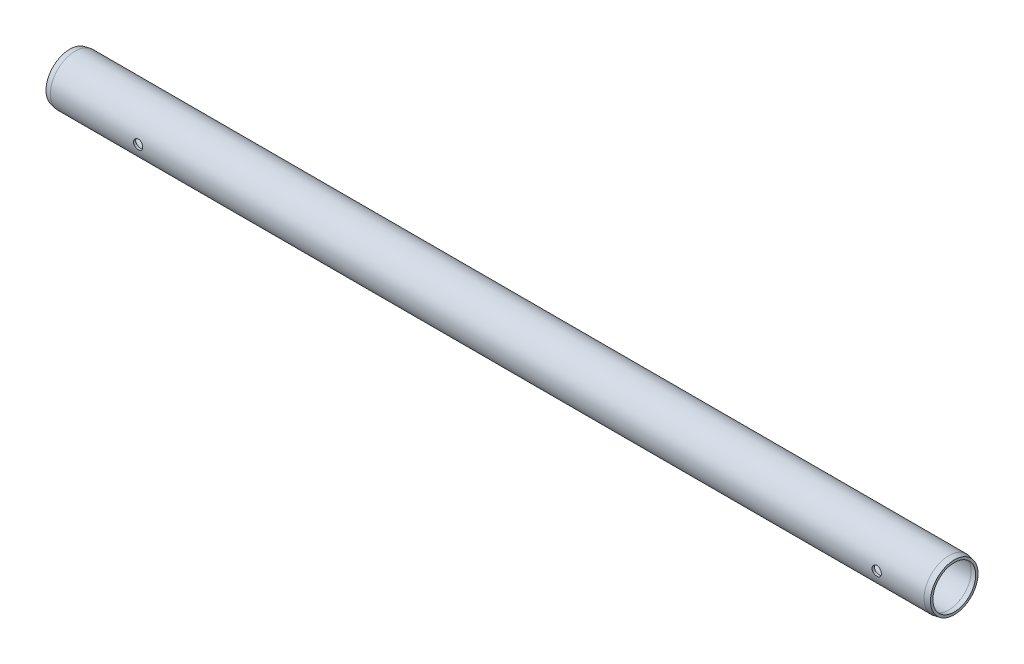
ISO-10303-21;
HEADER;
FILE_DESCRIPTION(('STEP AP214'),'2;1');
FILE_NAME('part.step','',(''),(''),'','','');
FILE_SCHEMA(('AUTOMOTIVE_DESIGN { 1 0 10303 214 1 1 1 1 }'));
ENDSEC;
DATA;
#1=APPLICATION_CONTEXT('core data for automotive mechanical design processes');
#2=APPLICATION_PROTOCOL_DEFINITION('international standard','automotive_design',2000,#1);
#3=PRODUCT_CONTEXT('',#1,'mechanical');
#4=PRODUCT('Part','Part','',(#3));
#5=PRODUCT_RELATED_PRODUCT_CATEGORY('part','',(#4));
#6=PRODUCT_DEFINITION_FORMATION('','',#4);
#7=PRODUCT_DEFINITION_CONTEXT('part definition',#1,'design');
#8=PRODUCT_DEFINITION('design','',#6,#7);
#9=PRODUCT_DEFINITION_SHAPE('','',#8);
#10=(LENGTH_UNIT() NAMED_UNIT(*) SI_UNIT(.MILLI.,.METRE.));
#11=(NAMED_UNIT(*) PLANE_ANGLE_UNIT() SI_UNIT($,.RADIAN.));
#12=(NAMED_UNIT(*) SI_UNIT($,.STERADIAN.) SOLID_ANGLE_UNIT());
#13=UNCERTAINTY_MEASURE_WITH_UNIT(LENGTH_MEASURE(1.E-05),#10,'distance_accuracy_value','');
#14=(GEOMETRIC_REPRESENTATION_CONTEXT(3) GLOBAL_UNCERTAINTY_ASSIGNED_CONTEXT((#13)) GLOBAL_UNIT_ASSIGNED_CONTEXT((#10,
#11,#12)) REPRESENTATION_CONTEXT('',''));
#15=CARTESIAN_POINT('',(0.,0.,0.));
#16=DIRECTION('',(0.,0.,1.));
#17=DIRECTION('',(1.,0.,0.));
#18=AXIS2_PLACEMENT_3D('',#15,#16,#17);
#19=CARTESIAN_POINT('',(0.,0.,0.));
#20=DIRECTION('',(-1.,0.,0.));
#21=DIRECTION('',(0.,0.,1.));
#22=AXIS2_PLACEMENT_3D('',#19,#20,#21);
#23=CYLINDRICAL_SURFACE('',#22,7.25);
#24=CARTESIAN_POINT('',(269.5,0.,7.25));
#25=CARTESIAN_POINT('',(269.499997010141,0.0833039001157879,7.24999845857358));
#26=CARTESIAN_POINT('',(269.49303701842,0.166644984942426,7.248549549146));
#27=CARTESIAN_POINT('',(269.465405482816,0.330967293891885,7.2429093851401));
#28=CARTESIAN_POINT('',(269.444723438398,0.411946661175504,7.23871603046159));
#29=CARTESIAN_POINT('',(269.390317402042,0.569146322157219,7.22805474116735));
#30=CARTESIAN_POINT('',(269.356606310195,0.645371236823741,7.2215890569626));
#31=CARTESIAN_POINT('',(269.277138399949,0.791078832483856,7.20708417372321));
#32=CARTESIAN_POINT('',(269.231382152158,0.860561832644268,7.19904504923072));
#33=CARTESIAN_POINT('',(269.128422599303,0.99182113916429,7.18214677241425));
#34=CARTESIAN_POINT('',(269.07107881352,1.05348607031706,7.17327835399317));
#35=CARTESIAN_POINT('',(268.94687381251,1.16639392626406,7.15578765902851));
#36=CARTESIAN_POINT('',(268.880011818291,1.21763599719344,7.1471654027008));
#37=CARTESIAN_POINT('',(268.737859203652,1.30872383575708,7.13105249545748));
#38=CARTESIAN_POINT('',(268.662492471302,1.34845311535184,7.12357375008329));
#39=CARTESIAN_POINT('',(268.505972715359,1.41464100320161,7.11072675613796));
#40=CARTESIAN_POINT('',(268.42482030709,1.44110102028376,7.10535828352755));
#41=CARTESIAN_POINT('',(268.260234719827,1.47963536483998,7.0974336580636));
#42=CARTESIAN_POINT('',(268.176849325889,1.49190575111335,7.09483921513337));
#43=CARTESIAN_POINT('',(268.009166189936,1.50232173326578,7.0926412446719));
#44=CARTESIAN_POINT('',(267.924868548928,1.5004688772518,7.09303738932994));
#45=CARTESIAN_POINT('',(267.759196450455,1.48284922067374,7.09674108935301));
#46=CARTESIAN_POINT('',(267.677796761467,1.46730824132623,7.10000139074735));
#47=CARTESIAN_POINT('',(267.51878553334,1.42311041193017,7.10899153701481));
#48=CARTESIAN_POINT('',(267.441174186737,1.39445289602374,7.11472150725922));
#49=CARTESIAN_POINT('',(267.291297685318,1.32462283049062,7.12805305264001));
#50=CARTESIAN_POINT('',(267.219075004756,1.28336173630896,7.135667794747));
#51=CARTESIAN_POINT('',(267.082494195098,1.18955816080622,7.15190257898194));
#52=CARTESIAN_POINT('',(267.018137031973,1.13701429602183,7.16052274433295));
#53=CARTESIAN_POINT('',(266.897812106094,1.02093253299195,7.17800111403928));
#54=CARTESIAN_POINT('',(266.842030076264,0.957202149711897,7.18686070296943));
#55=CARTESIAN_POINT('',(266.741917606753,0.82119353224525,7.20366773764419));
#56=CARTESIAN_POINT('',(266.697587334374,0.748915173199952,7.21161517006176));
#57=CARTESIAN_POINT('',(266.621598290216,0.597648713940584,7.22572411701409));
#58=CARTESIAN_POINT('',(266.589961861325,0.518649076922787,7.23188247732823));
#59=CARTESIAN_POINT('',(266.540462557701,0.356300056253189,7.24169565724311));
#60=CARTESIAN_POINT('',(266.522597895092,0.272951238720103,7.2453508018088));
#61=CARTESIAN_POINT('',(266.501414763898,0.105864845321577,7.24970009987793));
#62=CARTESIAN_POINT('',(266.497842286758,0.0221607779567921,7.25044595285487));
#63=CARTESIAN_POINT('',(266.504659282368,-0.144648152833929,7.24903668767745));
#64=CARTESIAN_POINT('',(266.515047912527,-0.227753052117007,7.2468817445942));
#65=CARTESIAN_POINT('',(266.549281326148,-0.390177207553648,7.23994546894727));
#66=CARTESIAN_POINT('',(266.572994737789,-0.469525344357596,7.23518978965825));
#67=CARTESIAN_POINT('',(266.633060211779,-0.623118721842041,7.22358363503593));
#68=CARTESIAN_POINT('',(266.669413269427,-0.697363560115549,7.21673299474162));
#69=CARTESIAN_POINT('',(266.754268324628,-0.839706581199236,7.20156844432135));
#70=CARTESIAN_POINT('',(266.802921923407,-0.907712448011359,7.19323669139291));
#71=CARTESIAN_POINT('',(266.910795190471,-1.03468569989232,7.17607398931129));
#72=CARTESIAN_POINT('',(266.97001607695,-1.09365204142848,7.16724298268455));
#73=CARTESIAN_POINT('',(267.09850263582,-1.20186137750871,7.14990125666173));
#74=CARTESIAN_POINT('',(267.167916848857,-1.25092943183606,7.14139814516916));
#75=CARTESIAN_POINT('',(267.31415094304,-1.33671076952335,7.1258411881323));
#76=CARTESIAN_POINT('',(267.390970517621,-1.37342456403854,7.11878728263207));
#77=CARTESIAN_POINT('',(267.549436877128,-1.43322178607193,7.10698989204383));
#78=CARTESIAN_POINT('',(267.63105511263,-1.4563783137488,7.10223404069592));
#79=CARTESIAN_POINT('',(267.797133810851,-1.48862289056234,7.09554634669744));
#80=CARTESIAN_POINT('',(267.881593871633,-1.49771292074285,7.09361410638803));
#81=CARTESIAN_POINT('',(268.049199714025,-1.50148916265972,7.09281556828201));
#82=CARTESIAN_POINT('',(268.132339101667,-1.49645212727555,7.09389036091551));
#83=CARTESIAN_POINT('',(268.296557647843,-1.47273085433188,7.09885258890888));
#84=CARTESIAN_POINT('',(268.377636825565,-1.45404674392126,7.10273999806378));
#85=CARTESIAN_POINT('',(268.535241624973,-1.40368889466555,7.11286224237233));
#86=CARTESIAN_POINT('',(268.611779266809,-1.37205137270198,7.11909052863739));
#87=CARTESIAN_POINT('',(268.758502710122,-1.29671750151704,7.13319604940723));
#88=CARTESIAN_POINT('',(268.828687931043,-1.25302005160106,7.14107343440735));
#89=CARTESIAN_POINT('',(268.962087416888,-1.15387128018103,7.15776829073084));
#90=CARTESIAN_POINT('',(269.025152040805,-1.09822102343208,7.16660022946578));
#91=CARTESIAN_POINT('',(269.141138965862,-0.977154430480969,7.18410765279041));
#92=CARTESIAN_POINT('',(269.194058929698,-0.911735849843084,7.19278310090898));
#93=CARTESIAN_POINT('',(269.28882416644,-0.772096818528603,7.20911635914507));
#94=CARTESIAN_POINT('',(269.330537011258,-0.697784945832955,7.21676151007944));
#95=CARTESIAN_POINT('',(269.400815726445,-0.543066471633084,7.23004740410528));
#96=CARTESIAN_POINT('',(269.429393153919,-0.462665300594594,7.23568990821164));
#97=CARTESIAN_POINT('',(269.467212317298,-0.318431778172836,7.24327038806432));
#98=CARTESIAN_POINT('',(269.479485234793,-0.25540657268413,7.24577891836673));
#99=CARTESIAN_POINT('',(269.495880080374,-0.128261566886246,7.24914428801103));
#100=CARTESIAN_POINT('',(269.500002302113,-0.0641418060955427,7.25000118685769));
#101=CARTESIAN_POINT('',(269.5,0.,7.25));
#102=B_SPLINE_CURVE_WITH_KNOTS('',3,(#24,#25,#26,#27,#28,#29,#30,#31,#32,#33,#34,#35,#36,#37,
#38,#39,#40,#41,#42,#43,#44,#45,#46,#47,#48,#49,#50,#51,#52,#53,#54,#55,#56,#57,#58,#59,#60,#61,
#62,#63,#64,#65,#66,#67,#68,#69,#70,#71,#72,#73,#74,#75,#76,#77,#78,#79,#80,#81,#82,#83,#84,#85,
#86,#87,#88,#89,#90,#91,#92,#93,#94,#95,#96,#97,#98,#99,#100,#101),.UNSPECIFIED.,.T.,.F.,(4,2,2,
2,2,2,2,2,2,2,2,2,2,2,2,2,2,2,2,2,2,2,2,2,2,2,2,2,2,2,2,2,2,2,2,2,2,2,4),(0.,0.249677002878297,
0.499545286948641,0.749166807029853,0.998776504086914,1.25161657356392,1.50447734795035,
1.75981377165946,2.01512307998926,2.26686095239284,2.5185712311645,2.76620508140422,
3.01385150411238,3.26327938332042,3.51273786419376,3.7670073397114,4.02128052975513,
4.27599933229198,4.53068506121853,4.78082371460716,5.03094727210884,5.27864701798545,
5.52636627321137,5.7773016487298,6.02826597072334,6.28333787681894,6.53839922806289,
6.7920723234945,7.04570968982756,7.2944131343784,7.54311426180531,7.79112473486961,
8.03915785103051,8.29169270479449,8.5442856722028,8.79974378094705,9.05497669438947,
9.24722832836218,9.43947303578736),.UNSPECIFIED.);
#103=CARTESIAN_POINT('',(269.5,0.,7.25));
#104=VERTEX_POINT('',#103);
#105=EDGE_CURVE('E61',#104,#104,#102,.T.);
#106=ORIENTED_EDGE('',*,*,#105,.T.);
#107=EDGE_LOOP('',(#106));
#108=FACE_BOUND('',#107,.T.);
#109=CARTESIAN_POINT('',(269.5,0.,-7.25));
#110=CARTESIAN_POINT('',(269.499997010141,-0.0833039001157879,-7.24999845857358));
#111=CARTESIAN_POINT('',(269.49303701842,-0.166644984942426,-7.248549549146));
#112=CARTESIAN_POINT('',(269.465405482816,-0.330967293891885,-7.2429093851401));
#113=CARTESIAN_POINT('',(269.444723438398,-0.411946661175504,-7.23871603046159));
#114=CARTESIAN_POINT('',(269.390317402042,-0.569146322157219,-7.22805474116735));
#115=CARTESIAN_POINT('',(269.356606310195,-0.645371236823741,-7.2215890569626));
#116=CARTESIAN_POINT('',(269.277138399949,-0.791078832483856,-7.20708417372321));
#117=CARTESIAN_POINT('',(269.231382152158,-0.860561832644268,-7.19904504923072));
#118=CARTESIAN_POINT('',(269.128422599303,-0.99182113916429,-7.18214677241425));
#119=CARTESIAN_POINT('',(269.07107881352,-1.05348607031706,-7.17327835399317));
#120=CARTESIAN_POINT('',(268.94687381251,-1.16639392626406,-7.15578765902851));
#121=CARTESIAN_POINT('',(268.880011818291,-1.21763599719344,-7.1471654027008));
#122=CARTESIAN_POINT('',(268.737859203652,-1.30872383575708,-7.13105249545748));
#123=CARTESIAN_POINT('',(268.662492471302,-1.34845311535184,-7.12357375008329));
#124=CARTESIAN_POINT('',(268.505972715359,-1.41464100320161,-7.11072675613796));
#125=CARTESIAN_POINT('',(268.42482030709,-1.44110102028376,-7.10535828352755));
#126=CARTESIAN_POINT('',(268.260234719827,-1.47963536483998,-7.0974336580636));
#127=CARTESIAN_POINT('',(268.176849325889,-1.49190575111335,-7.09483921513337));
#128=CARTESIAN_POINT('',(268.009166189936,-1.50232173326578,-7.0926412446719));
#129=CARTESIAN_POINT('',(267.924868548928,-1.5004688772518,-7.09303738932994));
#130=CARTESIAN_POINT('',(267.759196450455,-1.48284922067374,-7.09674108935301));
#131=CARTESIAN_POINT('',(267.677796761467,-1.46730824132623,-7.10000139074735));
#132=CARTESIAN_POINT('',(267.51878553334,-1.42311041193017,-7.10899153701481));
#133=CARTESIAN_POINT('',(267.441174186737,-1.39445289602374,-7.11472150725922));
#134=CARTESIAN_POINT('',(267.291297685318,-1.32462283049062,-7.12805305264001));
#135=CARTESIAN_POINT('',(267.219075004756,-1.28336173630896,-7.135667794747));
#136=CARTESIAN_POINT('',(267.082494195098,-1.18955816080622,-7.15190257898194));
#137=CARTESIAN_POINT('',(267.018137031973,-1.13701429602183,-7.16052274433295));
#138=CARTESIAN_POINT('',(266.897812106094,-1.02093253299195,-7.17800111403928));
#139=CARTESIAN_POINT('',(266.842030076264,-0.957202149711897,-7.18686070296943));
#140=CARTESIAN_POINT('',(266.741917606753,-0.82119353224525,-7.20366773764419));
#141=CARTESIAN_POINT('',(266.697587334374,-0.748915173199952,-7.21161517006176));
#142=CARTESIAN_POINT('',(266.621598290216,-0.597648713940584,-7.22572411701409));
#143=CARTESIAN_POINT('',(266.589961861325,-0.518649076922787,-7.23188247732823));
#144=CARTESIAN_POINT('',(266.540462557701,-0.356300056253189,-7.24169565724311));
#145=CARTESIAN_POINT('',(266.522597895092,-0.272951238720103,-7.2453508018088));
#146=CARTESIAN_POINT('',(266.501414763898,-0.105864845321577,-7.24970009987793));
#147=CARTESIAN_POINT('',(266.497842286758,-0.0221607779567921,-7.25044595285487));
#148=CARTESIAN_POINT('',(266.504659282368,0.144648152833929,-7.24903668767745));
#149=CARTESIAN_POINT('',(266.515047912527,0.227753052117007,-7.2468817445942));
#150=CARTESIAN_POINT('',(266.549281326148,0.390177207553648,-7.23994546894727));
#151=CARTESIAN_POINT('',(266.572994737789,0.469525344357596,-7.23518978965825));
#152=CARTESIAN_POINT('',(266.633060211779,0.623118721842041,-7.22358363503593));
#153=CARTESIAN_POINT('',(266.669413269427,0.697363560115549,-7.21673299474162));
#154=CARTESIAN_POINT('',(266.754268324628,0.839706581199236,-7.20156844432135));
#155=CARTESIAN_POINT('',(266.802921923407,0.907712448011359,-7.19323669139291));
#156=CARTESIAN_POINT('',(266.910795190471,1.03468569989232,-7.17607398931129));
#157=CARTESIAN_POINT('',(266.97001607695,1.09365204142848,-7.16724298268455));
#158=CARTESIAN_POINT('',(267.09850263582,1.20186137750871,-7.14990125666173));
#159=CARTESIAN_POINT('',(267.167916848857,1.25092943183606,-7.14139814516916));
#160=CARTESIAN_POINT('',(267.31415094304,1.33671076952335,-7.1258411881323));
#161=CARTESIAN_POINT('',(267.390970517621,1.37342456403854,-7.11878728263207));
#162=CARTESIAN_POINT('',(267.549436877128,1.43322178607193,-7.10698989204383));
#163=CARTESIAN_POINT('',(267.63105511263,1.4563783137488,-7.10223404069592));
#164=CARTESIAN_POINT('',(267.797133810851,1.48862289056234,-7.09554634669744));
#165=CARTESIAN_POINT('',(267.881593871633,1.49771292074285,-7.09361410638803));
#166=CARTESIAN_POINT('',(268.049199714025,1.50148916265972,-7.09281556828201));
#167=CARTESIAN_POINT('',(268.132339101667,1.49645212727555,-7.09389036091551));
#168=CARTESIAN_POINT('',(268.296557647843,1.47273085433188,-7.09885258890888));
#169=CARTESIAN_POINT('',(268.377636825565,1.45404674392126,-7.10273999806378));
#170=CARTESIAN_POINT('',(268.535241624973,1.40368889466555,-7.11286224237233));
#171=CARTESIAN_POINT('',(268.611779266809,1.37205137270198,-7.11909052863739));
#172=CARTESIAN_POINT('',(268.758502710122,1.29671750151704,-7.13319604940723));
#173=CARTESIAN_POINT('',(268.828687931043,1.25302005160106,-7.14107343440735));
#174=CARTESIAN_POINT('',(268.962087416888,1.15387128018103,-7.15776829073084));
#175=CARTESIAN_POINT('',(269.025152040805,1.09822102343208,-7.16660022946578));
#176=CARTESIAN_POINT('',(269.141138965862,0.977154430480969,-7.18410765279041));
#177=CARTESIAN_POINT('',(269.194058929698,0.911735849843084,-7.19278310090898));
#178=CARTESIAN_POINT('',(269.28882416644,0.772096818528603,-7.20911635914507));
#179=CARTESIAN_POINT('',(269.330537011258,0.697784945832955,-7.21676151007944));
#180=CARTESIAN_POINT('',(269.400815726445,0.543066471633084,-7.23004740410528));
#181=CARTESIAN_POINT('',(269.429393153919,0.462665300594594,-7.23568990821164));
#182=CARTESIAN_POINT('',(269.467212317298,0.318431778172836,-7.24327038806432));
#183=CARTESIAN_POINT('',(269.479485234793,0.25540657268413,-7.24577891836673));
#184=CARTESIAN_POINT('',(269.495880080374,0.128261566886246,-7.24914428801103));
#185=CARTESIAN_POINT('',(269.500002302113,0.0641418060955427,-7.25000118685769));
#186=CARTESIAN_POINT('',(269.5,0.,-7.25));
#187=B_SPLINE_CURVE_WITH_KNOTS('',3,(#109,#110,#111,#112,#113,#114,#115,#116,#117,#118,#119,
#120,#121,#122,#123,#124,#125,#126,#127,#128,#129,#130,#131,#132,#133,#134,#135,#136,#137,#138,
#139,#140,#141,#142,#143,#144,#145,#146,#147,#148,#149,#150,#151,#152,#153,#154,#155,#156,#157,
#158,#159,#160,#161,#162,#163,#164,#165,#166,#167,#168,#169,#170,#171,#172,#173,#174,#175,#176,
#177,#178,#179,#180,#181,#182,#183,#184,#185,#186),.UNSPECIFIED.,.T.,.F.,(4,2,2,2,2,2,2,2,2,2,2,
2,2,2,2,2,2,2,2,2,2,2,2,2,2,2,2,2,2,2,2,2,2,2,2,2,2,2,4),(0.,0.249677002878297,
0.499545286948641,0.749166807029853,0.998776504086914,1.25161657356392,1.50447734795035,
1.75981377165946,2.01512307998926,2.26686095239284,2.5185712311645,2.76620508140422,
3.01385150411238,3.26327938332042,3.51273786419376,3.7670073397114,4.02128052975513,
4.27599933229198,4.53068506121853,4.78082371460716,5.03094727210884,5.27864701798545,
5.52636627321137,5.7773016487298,6.02826597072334,6.28333787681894,6.53839922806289,
6.7920723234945,7.04570968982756,7.2944131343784,7.54311426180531,7.79112473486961,
8.03915785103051,8.29169270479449,8.5442856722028,8.79974378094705,9.05497669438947,
9.24722832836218,9.43947303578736),.UNSPECIFIED.);
#188=CARTESIAN_POINT('',(269.5,0.,-7.25));
#189=VERTEX_POINT('',#188);
#190=EDGE_CURVE('E149',#189,#189,#187,.T.);
#191=ORIENTED_EDGE('',*,*,#190,.T.);
#192=EDGE_LOOP('',(#191));
#193=FACE_BOUND('',#192,.T.);
#194=CARTESIAN_POINT('',(31.5,0.,7.25));
#195=CARTESIAN_POINT('',(31.4999970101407,0.0833039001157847,7.24999845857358));
#196=CARTESIAN_POINT('',(31.4930370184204,0.166644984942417,7.248549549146));
#197=CARTESIAN_POINT('',(31.4654054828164,0.330967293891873,7.2429093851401));
#198=CARTESIAN_POINT('',(31.4447234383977,0.411946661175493,7.23871603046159));
#199=CARTESIAN_POINT('',(31.3903174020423,0.5691463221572,7.22805474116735));
#200=CARTESIAN_POINT('',(31.3566063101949,0.645371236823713,7.2215890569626));
#201=CARTESIAN_POINT('',(31.2771383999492,0.791078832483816,7.20708417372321));
#202=CARTESIAN_POINT('',(31.2313821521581,0.860561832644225,7.19904504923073));
#203=CARTESIAN_POINT('',(31.1284225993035,0.991821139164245,7.18214677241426));
#204=CARTESIAN_POINT('',(31.0710788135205,1.05348607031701,7.17327835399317));
#205=CARTESIAN_POINT('',(30.9468738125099,1.16639392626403,7.15578765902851));
#206=CARTESIAN_POINT('',(30.8800118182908,1.21763599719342,7.14716540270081));
#207=CARTESIAN_POINT('',(30.7378592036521,1.30872383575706,7.13105249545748));
#208=CARTESIAN_POINT('',(30.6624924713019,1.34845311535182,7.12357375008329));
#209=CARTESIAN_POINT('',(30.5059727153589,1.41464100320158,7.11072675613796));
#210=CARTESIAN_POINT('',(30.4248203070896,1.44110102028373,7.10535828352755));
#211=CARTESIAN_POINT('',(30.2602347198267,1.47963536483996,7.0974336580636));
#212=CARTESIAN_POINT('',(30.1768493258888,1.49190575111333,7.09483921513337));
#213=CARTESIAN_POINT('',(30.0091661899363,1.50232173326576,7.0926412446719));
#214=CARTESIAN_POINT('',(29.9248685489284,1.50046887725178,7.09303738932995));
#215=CARTESIAN_POINT('',(29.7591964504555,1.48284922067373,7.09674108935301));
#216=CARTESIAN_POINT('',(29.6777967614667,1.46730824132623,7.10000139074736));
#217=CARTESIAN_POINT('',(29.5187855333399,1.42311041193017,7.10899153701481));
#218=CARTESIAN_POINT('',(29.4411741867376,1.39445289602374,7.11472150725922));
#219=CARTESIAN_POINT('',(29.2912976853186,1.32462283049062,7.12805305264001));
#220=CARTESIAN_POINT('',(29.2190750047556,1.28336173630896,7.13566779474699));
#221=CARTESIAN_POINT('',(29.0824941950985,1.18955816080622,7.15190257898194));
#222=CARTESIAN_POINT('',(29.0181370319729,1.13701429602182,7.16052274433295));
#223=CARTESIAN_POINT('',(28.8978121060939,1.02093253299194,7.17800111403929));
#224=CARTESIAN_POINT('',(28.8420300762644,0.957202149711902,7.18686070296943));
#225=CARTESIAN_POINT('',(28.7419176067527,0.821193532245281,7.20366773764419));
#226=CARTESIAN_POINT('',(28.6975873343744,0.748915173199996,7.21161517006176));
#227=CARTESIAN_POINT('',(28.6215982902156,0.597648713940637,7.22572411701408));
#228=CARTESIAN_POINT('',(28.5899618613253,0.518649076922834,7.23188247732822));
#229=CARTESIAN_POINT('',(28.5404625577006,0.356300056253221,7.2416956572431));
#230=CARTESIAN_POINT('',(28.5225978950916,0.272951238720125,7.2453508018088));
#231=CARTESIAN_POINT('',(28.5014147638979,0.105864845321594,7.24970009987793));
#232=CARTESIAN_POINT('',(28.497842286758,0.022160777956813,7.25044595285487));
#233=CARTESIAN_POINT('',(28.5046592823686,-0.144648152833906,7.24903668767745));
#234=CARTESIAN_POINT('',(28.5150479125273,-0.227753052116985,7.2468817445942));
#235=CARTESIAN_POINT('',(28.5492813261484,-0.390177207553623,7.23994546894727));
#236=CARTESIAN_POINT('',(28.5729947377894,-0.469525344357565,7.23518978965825));
#237=CARTESIAN_POINT('',(28.6330602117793,-0.623118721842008,7.22358363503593));
#238=CARTESIAN_POINT('',(28.6694132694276,-0.697363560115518,7.21673299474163));
#239=CARTESIAN_POINT('',(28.754268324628,-0.839706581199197,7.20156844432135));
#240=CARTESIAN_POINT('',(28.8029219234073,-0.907712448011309,7.19323669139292));
#241=CARTESIAN_POINT('',(28.9107951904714,-1.03468569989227,7.1760739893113));
#242=CARTESIAN_POINT('',(28.9700160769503,-1.09365204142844,7.16724298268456));
#243=CARTESIAN_POINT('',(29.0985026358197,-1.20186137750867,7.14990125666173));
#244=CARTESIAN_POINT('',(29.1679168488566,-1.250929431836,7.14139814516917));
#245=CARTESIAN_POINT('',(29.3141509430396,-1.33671076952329,7.12584118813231));
#246=CARTESIAN_POINT('',(29.3909705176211,-1.3734245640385,7.11878728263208));
#247=CARTESIAN_POINT('',(29.5494368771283,-1.4332217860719,7.10698989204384));
#248=CARTESIAN_POINT('',(29.6310551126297,-1.45637831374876,7.10223404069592));
#249=CARTESIAN_POINT('',(29.7971338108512,-1.48862289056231,7.09554634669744));
#250=CARTESIAN_POINT('',(29.8815938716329,-1.49771292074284,7.09361410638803));
#251=CARTESIAN_POINT('',(30.0491997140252,-1.5014891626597,7.09281556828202));
#252=CARTESIAN_POINT('',(30.132339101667,-1.49645212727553,7.09389036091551));
#253=CARTESIAN_POINT('',(30.2965576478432,-1.47273085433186,7.09885258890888));
#254=CARTESIAN_POINT('',(30.3776368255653,-1.45404674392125,7.10273999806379));
#255=CARTESIAN_POINT('',(30.5352416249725,-1.40368889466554,7.11286224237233));
#256=CARTESIAN_POINT('',(30.6117792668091,-1.37205137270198,7.11909052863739));
#257=CARTESIAN_POINT('',(30.7585027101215,-1.29671750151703,7.13319604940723));
#258=CARTESIAN_POINT('',(30.8286879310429,-1.25302005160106,7.14107343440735));
#259=CARTESIAN_POINT('',(30.9620874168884,-1.15387128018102,7.15776829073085));
#260=CARTESIAN_POINT('',(31.0251520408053,-1.09822102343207,7.16660022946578));
#261=CARTESIAN_POINT('',(31.1411389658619,-0.977154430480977,7.18410765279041));
#262=CARTESIAN_POINT('',(31.1940589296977,-0.911735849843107,7.19278310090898));
#263=CARTESIAN_POINT('',(31.2888241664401,-0.772096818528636,7.20911635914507));
#264=CARTESIAN_POINT('',(31.3305370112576,-0.697784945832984,7.21676151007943));
#265=CARTESIAN_POINT('',(31.4008157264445,-0.543066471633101,7.23004740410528));
#266=CARTESIAN_POINT('',(31.4293931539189,-0.462665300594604,7.23568990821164));
#267=CARTESIAN_POINT('',(31.467212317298,-0.318431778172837,7.24327038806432));
#268=CARTESIAN_POINT('',(31.4794852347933,-0.255406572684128,7.24577891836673));
#269=CARTESIAN_POINT('',(31.4958800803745,-0.128261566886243,7.24914428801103));
#270=CARTESIAN_POINT('',(31.5000023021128,-0.0641418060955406,7.25000118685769));
#271=CARTESIAN_POINT('',(31.5,0.,7.25));
#272=B_SPLINE_CURVE_WITH_KNOTS('',3,(#194,#195,#196,#197,#198,#199,#200,#201,#202,#203,#204,
#205,#206,#207,#208,#209,#210,#211,#212,#213,#214,#215,#216,#217,#218,#219,#220,#221,#222,#223,
#224,#225,#226,#227,#228,#229,#230,#231,#232,#233,#234,#235,#236,#237,#238,#239,#240,#241,#242,
#243,#244,#245,#246,#247,#248,#249,#250,#251,#252,#253,#254,#255,#256,#257,#258,#259,#260,#261,
#262,#263,#264,#265,#266,#267,#268,#269,#270,#271),.UNSPECIFIED.,.T.,.F.,(4,2,2,2,2,2,2,2,2,2,2,
2,2,2,2,2,2,2,2,2,2,2,2,2,2,2,2,2,2,2,2,2,2,2,2,2,2,2,4),(0.,0.24967700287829,0.499545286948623,
0.749166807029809,0.998776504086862,1.25161657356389,1.50447734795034,1.75981377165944,
2.01512307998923,2.26686095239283,2.51857123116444,2.76620508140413,3.01385150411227,
3.26327938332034,3.51273786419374,3.76700733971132,4.02128052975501,4.27599933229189,
4.53068506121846,4.78082371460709,5.03094727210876,5.27864701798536,5.52636627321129,
5.7773016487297,6.0282659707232,6.28333787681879,6.53839922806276,6.79207232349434,
7.04570968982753,7.29441313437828,7.54311426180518,7.79112473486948,8.03915785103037,
8.29169270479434,8.54428567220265,8.79974378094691,9.05497669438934,9.24722832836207,
9.43947303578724),.UNSPECIFIED.);
#273=CARTESIAN_POINT('',(31.5,0.,7.25));
#274=VERTEX_POINT('',#273);
#275=EDGE_CURVE('E89',#274,#274,#272,.T.);
#276=ORIENTED_EDGE('',*,*,#275,.T.);
#277=EDGE_LOOP('',(#276));
#278=FACE_BOUND('',#277,.T.);
#279=CARTESIAN_POINT('',(31.5,0.,-7.25));
#280=CARTESIAN_POINT('',(31.4999970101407,-0.0833039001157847,-7.24999845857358));
#281=CARTESIAN_POINT('',(31.4930370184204,-0.166644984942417,-7.248549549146));
#282=CARTESIAN_POINT('',(31.4654054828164,-0.330967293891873,-7.2429093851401));
#283=CARTESIAN_POINT('',(31.4447234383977,-0.411946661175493,-7.23871603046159));
#284=CARTESIAN_POINT('',(31.3903174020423,-0.5691463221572,-7.22805474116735));
#285=CARTESIAN_POINT('',(31.3566063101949,-0.645371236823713,-7.2215890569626));
#286=CARTESIAN_POINT('',(31.2771383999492,-0.791078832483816,-7.20708417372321));
#287=CARTESIAN_POINT('',(31.2313821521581,-0.860561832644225,-7.19904504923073));
#288=CARTESIAN_POINT('',(31.1284225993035,-0.991821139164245,-7.18214677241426));
#289=CARTESIAN_POINT('',(31.0710788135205,-1.05348607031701,-7.17327835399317));
#290=CARTESIAN_POINT('',(30.9468738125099,-1.16639392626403,-7.15578765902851));
#291=CARTESIAN_POINT('',(30.8800118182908,-1.21763599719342,-7.14716540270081));
#292=CARTESIAN_POINT('',(30.7378592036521,-1.30872383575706,-7.13105249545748));
#293=CARTESIAN_POINT('',(30.6624924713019,-1.34845311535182,-7.12357375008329));
#294=CARTESIAN_POINT('',(30.5059727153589,-1.41464100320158,-7.11072675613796));
#295=CARTESIAN_POINT('',(30.4248203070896,-1.44110102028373,-7.10535828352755));
#296=CARTESIAN_POINT('',(30.2602347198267,-1.47963536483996,-7.0974336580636));
#297=CARTESIAN_POINT('',(30.1768493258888,-1.49190575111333,-7.09483921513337));
#298=CARTESIAN_POINT('',(30.0091661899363,-1.50232173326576,-7.0926412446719));
#299=CARTESIAN_POINT('',(29.9248685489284,-1.50046887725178,-7.09303738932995));
#300=CARTESIAN_POINT('',(29.7591964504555,-1.48284922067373,-7.09674108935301));
#301=CARTESIAN_POINT('',(29.6777967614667,-1.46730824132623,-7.10000139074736));
#302=CARTESIAN_POINT('',(29.5187855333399,-1.42311041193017,-7.10899153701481));
#303=CARTESIAN_POINT('',(29.4411741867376,-1.39445289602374,-7.11472150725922));
#304=CARTESIAN_POINT('',(29.2912976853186,-1.32462283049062,-7.12805305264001));
#305=CARTESIAN_POINT('',(29.2190750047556,-1.28336173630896,-7.13566779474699));
#306=CARTESIAN_POINT('',(29.0824941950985,-1.18955816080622,-7.15190257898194));
#307=CARTESIAN_POINT('',(29.0181370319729,-1.13701429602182,-7.16052274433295));
#308=CARTESIAN_POINT('',(28.8978121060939,-1.02093253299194,-7.17800111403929));
#309=CARTESIAN_POINT('',(28.8420300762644,-0.957202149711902,-7.18686070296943));
#310=CARTESIAN_POINT('',(28.7419176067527,-0.821193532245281,-7.20366773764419));
#311=CARTESIAN_POINT('',(28.6975873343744,-0.748915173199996,-7.21161517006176));
#312=CARTESIAN_POINT('',(28.6215982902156,-0.597648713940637,-7.22572411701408));
#313=CARTESIAN_POINT('',(28.5899618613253,-0.518649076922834,-7.23188247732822));
#314=CARTESIAN_POINT('',(28.5404625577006,-0.356300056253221,-7.2416956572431));
#315=CARTESIAN_POINT('',(28.5225978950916,-0.272951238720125,-7.2453508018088));
#316=CARTESIAN_POINT('',(28.5014147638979,-0.105864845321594,-7.24970009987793));
#317=CARTESIAN_POINT('',(28.497842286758,-0.022160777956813,-7.25044595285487));
#318=CARTESIAN_POINT('',(28.5046592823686,0.144648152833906,-7.24903668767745));
#319=CARTESIAN_POINT('',(28.5150479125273,0.227753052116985,-7.2468817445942));
#320=CARTESIAN_POINT('',(28.5492813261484,0.390177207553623,-7.23994546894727));
#321=CARTESIAN_POINT('',(28.5729947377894,0.469525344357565,-7.23518978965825));
#322=CARTESIAN_POINT('',(28.6330602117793,0.623118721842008,-7.22358363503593));
#323=CARTESIAN_POINT('',(28.6694132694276,0.697363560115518,-7.21673299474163));
#324=CARTESIAN_POINT('',(28.754268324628,0.839706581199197,-7.20156844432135));
#325=CARTESIAN_POINT('',(28.8029219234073,0.907712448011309,-7.19323669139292));
#326=CARTESIAN_POINT('',(28.9107951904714,1.03468569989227,-7.1760739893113));
#327=CARTESIAN_POINT('',(28.9700160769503,1.09365204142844,-7.16724298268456));
#328=CARTESIAN_POINT('',(29.0985026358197,1.20186137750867,-7.14990125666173));
#329=CARTESIAN_POINT('',(29.1679168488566,1.250929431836,-7.14139814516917));
#330=CARTESIAN_POINT('',(29.3141509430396,1.33671076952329,-7.12584118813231));
#331=CARTESIAN_POINT('',(29.3909705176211,1.3734245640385,-7.11878728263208));
#332=CARTESIAN_POINT('',(29.5494368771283,1.4332217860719,-7.10698989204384));
#333=CARTESIAN_POINT('',(29.6310551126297,1.45637831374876,-7.10223404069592));
#334=CARTESIAN_POINT('',(29.7971338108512,1.48862289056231,-7.09554634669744));
#335=CARTESIAN_POINT('',(29.8815938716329,1.49771292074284,-7.09361410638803));
#336=CARTESIAN_POINT('',(30.0491997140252,1.5014891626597,-7.09281556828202));
#337=CARTESIAN_POINT('',(30.132339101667,1.49645212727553,-7.09389036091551));
#338=CARTESIAN_POINT('',(30.2965576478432,1.47273085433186,-7.09885258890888));
#339=CARTESIAN_POINT('',(30.3776368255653,1.45404674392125,-7.10273999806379));
#340=CARTESIAN_POINT('',(30.5352416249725,1.40368889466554,-7.11286224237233));
#341=CARTESIAN_POINT('',(30.6117792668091,1.37205137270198,-7.11909052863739));
#342=CARTESIAN_POINT('',(30.7585027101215,1.29671750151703,-7.13319604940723));
#343=CARTESIAN_POINT('',(30.8286879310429,1.25302005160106,-7.14107343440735));
#344=CARTESIAN_POINT('',(30.9620874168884,1.15387128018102,-7.15776829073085));
#345=CARTESIAN_POINT('',(31.0251520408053,1.09822102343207,-7.16660022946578));
#346=CARTESIAN_POINT('',(31.1411389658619,0.977154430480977,-7.18410765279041));
#347=CARTESIAN_POINT('',(31.1940589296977,0.911735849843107,-7.19278310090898));
#348=CARTESIAN_POINT('',(31.2888241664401,0.772096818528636,-7.20911635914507));
#349=CARTESIAN_POINT('',(31.3305370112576,0.697784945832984,-7.21676151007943));
#350=CARTESIAN_POINT('',(31.4008157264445,0.543066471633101,-7.23004740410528));
#351=CARTESIAN_POINT('',(31.4293931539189,0.462665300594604,-7.23568990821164));
#352=CARTESIAN_POINT('',(31.467212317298,0.318431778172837,-7.24327038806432));
#353=CARTESIAN_POINT('',(31.4794852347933,0.255406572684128,-7.24577891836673));
#354=CARTESIAN_POINT('',(31.4958800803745,0.128261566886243,-7.24914428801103));
#355=CARTESIAN_POINT('',(31.5000023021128,0.0641418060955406,-7.25000118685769));
#356=CARTESIAN_POINT('',(31.5,0.,-7.25));
#357=B_SPLINE_CURVE_WITH_KNOTS('',3,(#279,#280,#281,#282,#283,#284,#285,#286,#287,#288,#289,
#290,#291,#292,#293,#294,#295,#296,#297,#298,#299,#300,#301,#302,#303,#304,#305,#306,#307,#308,
#309,#310,#311,#312,#313,#314,#315,#316,#317,#318,#319,#320,#321,#322,#323,#324,#325,#326,#327,
#328,#329,#330,#331,#332,#333,#334,#335,#336,#337,#338,#339,#340,#341,#342,#343,#344,#345,#346,
#347,#348,#349,#350,#351,#352,#353,#354,#355,#356),.UNSPECIFIED.,.T.,.F.,(4,2,2,2,2,2,2,2,2,2,2,
2,2,2,2,2,2,2,2,2,2,2,2,2,2,2,2,2,2,2,2,2,2,2,2,2,2,2,4),(0.,0.24967700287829,0.499545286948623,
0.749166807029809,0.998776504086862,1.25161657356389,1.50447734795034,1.75981377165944,
2.01512307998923,2.26686095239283,2.51857123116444,2.76620508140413,3.01385150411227,
3.26327938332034,3.51273786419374,3.76700733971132,4.02128052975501,4.27599933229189,
4.53068506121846,4.78082371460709,5.03094727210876,5.27864701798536,5.52636627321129,
5.7773016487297,6.0282659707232,6.28333787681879,6.53839922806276,6.79207232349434,
7.04570968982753,7.29441313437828,7.54311426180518,7.79112473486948,8.03915785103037,
8.29169270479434,8.54428567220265,8.79974378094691,9.05497669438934,9.24722832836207,
9.43947303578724),.UNSPECIFIED.);
#358=CARTESIAN_POINT('',(31.5,0.,-7.25));
#359=VERTEX_POINT('',#358);
#360=EDGE_CURVE('E84',#359,#359,#357,.T.);
#361=ORIENTED_EDGE('',*,*,#360,.T.);
#362=EDGE_LOOP('',(#361));
#363=FACE_BOUND('',#362,.T.);
#364=CARTESIAN_POINT('',(1.81405336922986,0.,0.));
#365=DIRECTION('',(-1.,0.,0.));
#366=DIRECTION('',(0.,0.,1.));
#367=AXIS2_PLACEMENT_3D('',#364,#365,#366);
#368=CIRCLE('',#367,7.25);
#369=CARTESIAN_POINT('',(1.81405336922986,0.,7.25));
#370=VERTEX_POINT('',#369);
#371=EDGE_CURVE('E10',#370,#370,#368,.T.);
#372=ORIENTED_EDGE('',*,*,#371,.T.);
#373=EDGE_LOOP('',(#372));
#374=FACE_BOUND('',#373,.T.);
#375=CARTESIAN_POINT('',(283.18594663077,0.,0.));
#376=DIRECTION('',(-1.,0.,0.));
#377=DIRECTION('',(0.,0.,1.));
#378=AXIS2_PLACEMENT_3D('',#375,#376,#377);
#379=CIRCLE('',#378,7.25);
#380=CARTESIAN_POINT('',(283.18594663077,0.,7.25));
#381=VERTEX_POINT('',#380);
#382=EDGE_CURVE('E106',#381,#381,#379,.T.);
#383=ORIENTED_EDGE('',*,*,#382,.F.);
#384=EDGE_LOOP('',(#383));
#385=FACE_BOUND('',#384,.T.);
#386=ADVANCED_FACE('F33',(#108,#193,#278,#363,#374,#385),#23,.F.);
#387=CARTESIAN_POINT('',(0.000623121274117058,0.,0.));
#388=DIRECTION('',(1.,0.,0.));
#389=DIRECTION('',(0.,0.,-1.));
#390=AXIS2_PLACEMENT_3D('',#387,#388,#389);
#391=CONICAL_SURFACE('',#390,6.89325962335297,0.194240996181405);
#392=ORIENTED_EDGE('',*,*,#371,.F.);
#393=EDGE_LOOP('',(#392));
#394=FACE_BOUND('',#393,.T.);
#395=CARTESIAN_POINT('',(0.000623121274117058,0.,0.));
#396=DIRECTION('',(-1.,0.,0.));
#397=DIRECTION('',(0.,0.,1.));
#398=AXIS2_PLACEMENT_3D('',#395,#396,#397);
#399=CIRCLE('',#398,6.89325962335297);
#400=CARTESIAN_POINT('',(0.000623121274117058,0.,6.89325962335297));
#401=VERTEX_POINT('',#400);
#402=EDGE_CURVE('E45',#401,#401,#399,.T.);
#403=ORIENTED_EDGE('',*,*,#402,.T.);
#404=EDGE_LOOP('',(#403));
#405=FACE_BOUND('',#404,.T.);
#406=ADVANCED_FACE('F137',(#394,#405),#391,.F.);
#407=CARTESIAN_POINT('',(0.,0.,0.));
#408=DIRECTION('',(-1.,0.,0.));
#409=DIRECTION('',(0.,0.,1.));
#410=AXIS2_PLACEMENT_3D('',#407,#408,#409);
#411=CONICAL_SURFACE('',#410,7.6575115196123,1.56998099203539);
#412=ORIENTED_EDGE('',*,*,#402,.F.);
#413=EDGE_LOOP('',(#412));
#414=FACE_BOUND('',#413,.T.);
#415=CARTESIAN_POINT('',(0.,0.,0.));
#416=DIRECTION('',(-1.,0.,0.));
#417=DIRECTION('',(0.,0.,1.));
#418=AXIS2_PLACEMENT_3D('',#415,#416,#417);
#419=CIRCLE('',#418,7.6575115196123);
#420=CARTESIAN_POINT('',(0.,0.,7.6575115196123));
#421=VERTEX_POINT('',#420);
#422=EDGE_CURVE('E50',#421,#421,#419,.T.);
#423=ORIENTED_EDGE('',*,*,#422,.T.);
#424=EDGE_LOOP('',(#423));
#425=FACE_BOUND('',#424,.T.);
#426=ADVANCED_FACE('F114',(#414,#425),#411,.F.);
#427=CARTESIAN_POINT('',(1.74098310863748,0.,0.));
#428=DIRECTION('',(1.,0.,0.));
#429=DIRECTION('',(0.,0.,-1.));
#430=AXIS2_PLACEMENT_3D('',#427,#428,#429);
#431=CONICAL_SURFACE('',#430,8.,0.194240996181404);
#432=ORIENTED_EDGE('',*,*,#422,.F.);
#433=EDGE_LOOP('',(#432));
#434=FACE_BOUND('',#433,.T.);
#435=CARTESIAN_POINT('',(1.74098310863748,0.,0.));
#436=DIRECTION('',(-1.,0.,0.));
#437=DIRECTION('',(0.,0.,1.));
#438=AXIS2_PLACEMENT_3D('',#435,#436,#437);
#439=CIRCLE('',#438,8.);
#440=CARTESIAN_POINT('',(1.74098310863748,0.,8.));
#441=VERTEX_POINT('',#440);
#442=EDGE_CURVE('E109',#441,#441,#439,.T.);
#443=ORIENTED_EDGE('',*,*,#442,.T.);
#444=EDGE_LOOP('',(#443));
#445=FACE_BOUND('',#444,.T.);
#446=ADVANCED_FACE('F116',(#434,#445),#431,.T.);
#447=CARTESIAN_POINT('',(0.,0.,0.));
#448=DIRECTION('',(-1.,0.,0.));
#449=DIRECTION('',(0.,0.,1.));
#450=AXIS2_PLACEMENT_3D('',#447,#448,#449);
#451=CYLINDRICAL_SURFACE('',#450,8.);
#452=CARTESIAN_POINT('',(269.5,0.,8.));
#453=CARTESIAN_POINT('',(269.499996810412,-0.0834717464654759,7.99999848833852));
#454=CARTESIAN_POINT('',(269.493008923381,-0.166984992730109,7.99868009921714));
#455=CARTESIAN_POINT('',(269.465260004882,-0.331658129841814,7.9935478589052));
#456=CARTESIAN_POINT('',(269.44448734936,-0.412815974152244,7.98973190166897));
#457=CARTESIAN_POINT('',(269.389827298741,-0.570372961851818,7.98003138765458));
#458=CARTESIAN_POINT('',(269.355951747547,-0.646776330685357,7.97414869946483));
#459=CARTESIAN_POINT('',(269.276081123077,-0.792807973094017,7.96095710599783));
#460=CARTESIAN_POINT('',(269.230087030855,-0.862436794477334,7.9536483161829));
#461=CARTESIAN_POINT('',(269.126700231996,-0.993783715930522,7.93831336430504));
#462=CARTESIAN_POINT('',(269.06919055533,-1.05540895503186,7.93028034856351));
#463=CARTESIAN_POINT('',(268.944656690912,-1.16819606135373,7.9144531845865));
#464=CARTESIAN_POINT('',(268.877631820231,-1.21935717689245,7.90665905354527));
#465=CARTESIAN_POINT('',(268.735313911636,-1.31014998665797,7.89212551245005));
#466=CARTESIAN_POINT('',(268.659959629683,-1.34968721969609,7.88539493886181));
#467=CARTESIAN_POINT('',(268.503531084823,-1.41550524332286,7.87384713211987));
#468=CARTESIAN_POINT('',(268.422457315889,-1.44178717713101,7.86902973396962));
#469=CARTESIAN_POINT('',(268.257884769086,-1.48005053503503,7.8619226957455));
#470=CARTESIAN_POINT('',(268.174424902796,-1.49219390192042,7.85960445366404));
#471=CARTESIAN_POINT('',(268.006622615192,-1.50233808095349,7.85767197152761));
#472=CARTESIAN_POINT('',(267.922280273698,-1.50034016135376,7.85805748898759));
#473=CARTESIAN_POINT('',(267.756280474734,-1.48238979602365,7.86146292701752));
#474=CARTESIAN_POINT('',(267.6746022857,-1.46662149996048,7.86444808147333));
#475=CARTESIAN_POINT('',(267.515071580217,-1.4218679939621,7.87266183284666));
#476=CARTESIAN_POINT('',(267.437219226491,-1.39288222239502,7.87789052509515));
#477=CARTESIAN_POINT('',(267.287011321,-1.32233647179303,7.89003855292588));
#478=CARTESIAN_POINT('',(267.214691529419,-1.2807021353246,7.89696783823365));
#479=CARTESIAN_POINT('',(267.07799527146,-1.1860936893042,7.91172971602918));
#480=CARTESIAN_POINT('',(267.013619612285,-1.13311842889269,7.91956240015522));
#481=CARTESIAN_POINT('',(266.893575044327,-1.01633905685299,7.93540001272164));
#482=CARTESIAN_POINT('',(266.838059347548,-0.952377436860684,7.94340571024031));
#483=CARTESIAN_POINT('',(266.738522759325,-0.815968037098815,7.95857386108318));
#484=CARTESIAN_POINT('',(266.694501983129,-0.743520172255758,7.96573630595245));
#485=CARTESIAN_POINT('',(266.61918224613,-0.592034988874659,7.97842539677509));
#486=CARTESIAN_POINT('',(266.587899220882,-0.512989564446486,7.98394999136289));
#487=CARTESIAN_POINT('',(266.539097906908,-0.350639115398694,7.99272505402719));
#488=CARTESIAN_POINT('',(266.521578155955,-0.267334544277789,7.99597576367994));
#489=CARTESIAN_POINT('',(266.501013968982,-0.10014865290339,7.99980360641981));
#490=CARTESIAN_POINT('',(266.49775960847,-0.0162940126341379,8.00041950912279));
#491=CARTESIAN_POINT('',(266.505255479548,0.15076124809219,7.99901543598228));
#492=CARTESIAN_POINT('',(266.516005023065,0.233961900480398,7.99699558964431));
#493=CARTESIAN_POINT('',(266.551029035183,0.396681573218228,7.99057111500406));
#494=CARTESIAN_POINT('',(266.575197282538,0.476224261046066,7.98618522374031));
#495=CARTESIAN_POINT('',(266.636257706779,0.630128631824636,7.97551842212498));
#496=CARTESIAN_POINT('',(266.673150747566,0.704489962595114,7.96923738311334));
#497=CARTESIAN_POINT('',(266.759078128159,0.846816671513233,7.95538030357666));
#498=CARTESIAN_POINT('',(266.808240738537,0.914703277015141,7.94779086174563));
#499=CARTESIAN_POINT('',(266.917138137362,1.04133832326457,7.93219343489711));
#500=CARTESIAN_POINT('',(266.976873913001,1.10008590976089,7.92418541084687));
#501=CARTESIAN_POINT('',(267.106172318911,1.2075729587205,7.9085247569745));
#502=CARTESIAN_POINT('',(267.175854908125,1.25616916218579,7.90087825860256));
#503=CARTESIAN_POINT('',(267.322517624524,1.34096675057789,7.88692985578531));
#504=CARTESIAN_POINT('',(267.39949748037,1.37716859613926,7.88062790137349));
#505=CARTESIAN_POINT('',(267.558205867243,1.43594673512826,7.87013024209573));
#506=CARTESIAN_POINT('',(267.639909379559,1.45858868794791,7.86592440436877));
#507=CARTESIAN_POINT('',(267.806047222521,1.48980679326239,7.86007203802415));
#508=CARTESIAN_POINT('',(267.89048124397,1.49838453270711,7.85842522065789));
#509=CARTESIAN_POINT('',(268.058248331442,1.50117762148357,7.85789199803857));
#510=CARTESIAN_POINT('',(268.141577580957,1.49561895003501,7.85896215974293));
#511=CARTESIAN_POINT('',(268.306091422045,1.47079175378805,7.86364600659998));
#512=CARTESIAN_POINT('',(268.387276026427,1.45152331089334,7.86725967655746));
#513=CARTESIAN_POINT('',(268.545074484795,1.39991887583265,7.8766050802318));
#514=CARTESIAN_POINT('',(268.621696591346,1.36760735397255,7.88233284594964));
#515=CARTESIAN_POINT('',(268.768468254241,1.29085868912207,7.8952638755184));
#516=CARTESIAN_POINT('',(268.838617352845,1.24642068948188,7.90246724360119));
#517=CARTESIAN_POINT('',(268.971583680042,1.14589487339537,7.91767266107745));
#518=CARTESIAN_POINT('',(269.034275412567,1.08964259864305,7.92568505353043));
#519=CARTESIAN_POINT('',(269.149405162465,0.967427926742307,7.94152833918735));
#520=CARTESIAN_POINT('',(269.20184082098,0.901463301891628,7.94935919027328));
#521=CARTESIAN_POINT('',(269.295410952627,0.760984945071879,7.96403975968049));
#522=CARTESIAN_POINT('',(269.336439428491,0.686399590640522,7.97088000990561));
#523=CARTESIAN_POINT('',(269.405317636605,0.531290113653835,7.98271619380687));
#524=CARTESIAN_POINT('',(269.433179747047,0.450771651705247,7.98771385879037));
#525=CARTESIAN_POINT('',(269.469277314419,0.308347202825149,7.99428290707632));
#526=CARTESIAN_POINT('',(269.480778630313,0.247273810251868,7.99641470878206));
#527=CARTESIAN_POINT('',(269.496141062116,0.124141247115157,7.9992737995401));
#528=CARTESIAN_POINT('',(269.500002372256,0.062082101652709,8.00000112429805));
#529=CARTESIAN_POINT('',(269.5,0.,8.));
#530=B_SPLINE_CURVE_WITH_KNOTS('',3,(#452,#453,#454,#455,#456,#457,#458,#459,#460,#461,#462,
#463,#464,#465,#466,#467,#468,#469,#470,#471,#472,#473,#474,#475,#476,#477,#478,#479,#480,#481,
#482,#483,#484,#485,#486,#487,#488,#489,#490,#491,#492,#493,#494,#495,#496,#497,#498,#499,#500,
#501,#502,#503,#504,#505,#506,#507,#508,#509,#510,#511,#512,#513,#514,#515,#516,#517,#518,#519,
#520,#521,#522,#523,#524,#525,#526,#527,#528,#529),.UNSPECIFIED.,.T.,.F.,(4,2,2,2,2,2,2,2,2,2,2,
2,2,2,2,2,2,2,2,2,2,2,2,2,2,2,2,2,2,2,2,2,2,2,2,2,2,2,4),(0.,0.250188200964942,
0.500587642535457,0.750761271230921,1.00091465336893,1.25375118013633,1.50660586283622,
1.76146190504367,2.01629596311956,2.26818151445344,2.5200444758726,2.76859000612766,
3.0171460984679,3.26719262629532,3.51726454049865,3.77127768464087,4.02529337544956,
4.27962588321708,4.53393136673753,4.78448174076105,5.03501980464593,5.28360233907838,
5.53220175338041,5.78351778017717,6.03485728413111,6.28953436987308,6.54420198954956,
6.79762627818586,7.05102196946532,7.30039252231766,7.54976158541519,7.79866496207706,
8.04758592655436,8.30023369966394,8.5529395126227,8.80792048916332,9.06266126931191,
9.24874344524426,9.43482089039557),.UNSPECIFIED.);
#531=CARTESIAN_POINT('',(269.5,0.,8.));
#532=VERTEX_POINT('',#531);
#533=EDGE_CURVE('E37',#532,#532,#530,.T.);
#534=ORIENTED_EDGE('',*,*,#533,.T.);
#535=EDGE_LOOP('',(#534));
#536=FACE_BOUND('',#535,.T.);
#537=CARTESIAN_POINT('',(269.5,0.,-8.));
#538=CARTESIAN_POINT('',(269.499996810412,0.0834717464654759,-7.99999848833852));
#539=CARTESIAN_POINT('',(269.493008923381,0.166984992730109,-7.99868009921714));
#540=CARTESIAN_POINT('',(269.465260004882,0.331658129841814,-7.9935478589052));
#541=CARTESIAN_POINT('',(269.44448734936,0.412815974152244,-7.98973190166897));
#542=CARTESIAN_POINT('',(269.389827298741,0.570372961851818,-7.98003138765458));
#543=CARTESIAN_POINT('',(269.355951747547,0.646776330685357,-7.97414869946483));
#544=CARTESIAN_POINT('',(269.276081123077,0.792807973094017,-7.96095710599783));
#545=CARTESIAN_POINT('',(269.230087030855,0.862436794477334,-7.9536483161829));
#546=CARTESIAN_POINT('',(269.126700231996,0.993783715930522,-7.93831336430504));
#547=CARTESIAN_POINT('',(269.06919055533,1.05540895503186,-7.93028034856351));
#548=CARTESIAN_POINT('',(268.944656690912,1.16819606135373,-7.9144531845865));
#549=CARTESIAN_POINT('',(268.877631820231,1.21935717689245,-7.90665905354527));
#550=CARTESIAN_POINT('',(268.735313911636,1.31014998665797,-7.89212551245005));
#551=CARTESIAN_POINT('',(268.659959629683,1.34968721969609,-7.88539493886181));
#552=CARTESIAN_POINT('',(268.503531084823,1.41550524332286,-7.87384713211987));
#553=CARTESIAN_POINT('',(268.422457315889,1.44178717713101,-7.86902973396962));
#554=CARTESIAN_POINT('',(268.257884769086,1.48005053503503,-7.8619226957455));
#555=CARTESIAN_POINT('',(268.174424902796,1.49219390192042,-7.85960445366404));
#556=CARTESIAN_POINT('',(268.006622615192,1.50233808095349,-7.85767197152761));
#557=CARTESIAN_POINT('',(267.922280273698,1.50034016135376,-7.85805748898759));
#558=CARTESIAN_POINT('',(267.756280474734,1.48238979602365,-7.86146292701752));
#559=CARTESIAN_POINT('',(267.6746022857,1.46662149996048,-7.86444808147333));
#560=CARTESIAN_POINT('',(267.515071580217,1.4218679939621,-7.87266183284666));
#561=CARTESIAN_POINT('',(267.437219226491,1.39288222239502,-7.87789052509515));
#562=CARTESIAN_POINT('',(267.287011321,1.32233647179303,-7.89003855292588));
#563=CARTESIAN_POINT('',(267.214691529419,1.2807021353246,-7.89696783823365));
#564=CARTESIAN_POINT('',(267.07799527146,1.1860936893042,-7.91172971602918));
#565=CARTESIAN_POINT('',(267.013619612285,1.13311842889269,-7.91956240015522));
#566=CARTESIAN_POINT('',(266.893575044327,1.01633905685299,-7.93540001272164));
#567=CARTESIAN_POINT('',(266.838059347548,0.952377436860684,-7.94340571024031));
#568=CARTESIAN_POINT('',(266.738522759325,0.815968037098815,-7.95857386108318));
#569=CARTESIAN_POINT('',(266.694501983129,0.743520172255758,-7.96573630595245));
#570=CARTESIAN_POINT('',(266.61918224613,0.592034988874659,-7.97842539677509));
#571=CARTESIAN_POINT('',(266.587899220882,0.512989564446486,-7.98394999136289));
#572=CARTESIAN_POINT('',(266.539097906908,0.350639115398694,-7.99272505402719));
#573=CARTESIAN_POINT('',(266.521578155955,0.267334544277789,-7.99597576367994));
#574=CARTESIAN_POINT('',(266.501013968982,0.10014865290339,-7.99980360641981));
#575=CARTESIAN_POINT('',(266.49775960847,0.0162940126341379,-8.00041950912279));
#576=CARTESIAN_POINT('',(266.505255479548,-0.15076124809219,-7.99901543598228));
#577=CARTESIAN_POINT('',(266.516005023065,-0.233961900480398,-7.99699558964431));
#578=CARTESIAN_POINT('',(266.551029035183,-0.396681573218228,-7.99057111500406));
#579=CARTESIAN_POINT('',(266.575197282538,-0.476224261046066,-7.98618522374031));
#580=CARTESIAN_POINT('',(266.636257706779,-0.630128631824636,-7.97551842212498));
#581=CARTESIAN_POINT('',(266.673150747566,-0.704489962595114,-7.96923738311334));
#582=CARTESIAN_POINT('',(266.759078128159,-0.846816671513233,-7.95538030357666));
#583=CARTESIAN_POINT('',(266.808240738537,-0.914703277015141,-7.94779086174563));
#584=CARTESIAN_POINT('',(266.917138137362,-1.04133832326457,-7.93219343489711));
#585=CARTESIAN_POINT('',(266.976873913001,-1.10008590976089,-7.92418541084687));
#586=CARTESIAN_POINT('',(267.106172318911,-1.2075729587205,-7.9085247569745));
#587=CARTESIAN_POINT('',(267.175854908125,-1.25616916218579,-7.90087825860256));
#588=CARTESIAN_POINT('',(267.322517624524,-1.34096675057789,-7.88692985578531));
#589=CARTESIAN_POINT('',(267.39949748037,-1.37716859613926,-7.88062790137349));
#590=CARTESIAN_POINT('',(267.558205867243,-1.43594673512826,-7.87013024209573));
#591=CARTESIAN_POINT('',(267.639909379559,-1.45858868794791,-7.86592440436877));
#592=CARTESIAN_POINT('',(267.806047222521,-1.48980679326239,-7.86007203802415));
#593=CARTESIAN_POINT('',(267.89048124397,-1.49838453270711,-7.85842522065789));
#594=CARTESIAN_POINT('',(268.058248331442,-1.50117762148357,-7.85789199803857));
#595=CARTESIAN_POINT('',(268.141577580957,-1.49561895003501,-7.85896215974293));
#596=CARTESIAN_POINT('',(268.306091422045,-1.47079175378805,-7.86364600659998));
#597=CARTESIAN_POINT('',(268.387276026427,-1.45152331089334,-7.86725967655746));
#598=CARTESIAN_POINT('',(268.545074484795,-1.39991887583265,-7.8766050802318));
#599=CARTESIAN_POINT('',(268.621696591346,-1.36760735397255,-7.88233284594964));
#600=CARTESIAN_POINT('',(268.768468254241,-1.29085868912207,-7.8952638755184));
#601=CARTESIAN_POINT('',(268.838617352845,-1.24642068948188,-7.90246724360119));
#602=CARTESIAN_POINT('',(268.971583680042,-1.14589487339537,-7.91767266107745));
#603=CARTESIAN_POINT('',(269.034275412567,-1.08964259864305,-7.92568505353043));
#604=CARTESIAN_POINT('',(269.149405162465,-0.967427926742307,-7.94152833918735));
#605=CARTESIAN_POINT('',(269.20184082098,-0.901463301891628,-7.94935919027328));
#606=CARTESIAN_POINT('',(269.295410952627,-0.760984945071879,-7.96403975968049));
#607=CARTESIAN_POINT('',(269.336439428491,-0.686399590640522,-7.97088000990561));
#608=CARTESIAN_POINT('',(269.405317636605,-0.531290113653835,-7.98271619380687));
#609=CARTESIAN_POINT('',(269.433179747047,-0.450771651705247,-7.98771385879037));
#610=CARTESIAN_POINT('',(269.469277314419,-0.308347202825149,-7.99428290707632));
#611=CARTESIAN_POINT('',(269.480778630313,-0.247273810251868,-7.99641470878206));
#612=CARTESIAN_POINT('',(269.496141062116,-0.124141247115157,-7.9992737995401));
#613=CARTESIAN_POINT('',(269.500002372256,-0.062082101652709,-8.00000112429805));
#614=CARTESIAN_POINT('',(269.5,0.,-8.));
#615=B_SPLINE_CURVE_WITH_KNOTS('',3,(#537,#538,#539,#540,#541,#542,#543,#544,#545,#546,#547,
#548,#549,#550,#551,#552,#553,#554,#555,#556,#557,#558,#559,#560,#561,#562,#563,#564,#565,#566,
#567,#568,#569,#570,#571,#572,#573,#574,#575,#576,#577,#578,#579,#580,#581,#582,#583,#584,#585,
#586,#587,#588,#589,#590,#591,#592,#593,#594,#595,#596,#597,#598,#599,#600,#601,#602,#603,#604,
#605,#606,#607,#608,#609,#610,#611,#612,#613,#614),.UNSPECIFIED.,.T.,.F.,(4,2,2,2,2,2,2,2,2,2,2,
2,2,2,2,2,2,2,2,2,2,2,2,2,2,2,2,2,2,2,2,2,2,2,2,2,2,2,4),(0.,0.250188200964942,
0.500587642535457,0.750761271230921,1.00091465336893,1.25375118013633,1.50660586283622,
1.76146190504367,2.01629596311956,2.26818151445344,2.5200444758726,2.76859000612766,
3.0171460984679,3.26719262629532,3.51726454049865,3.77127768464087,4.02529337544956,
4.27962588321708,4.53393136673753,4.78448174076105,5.03501980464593,5.28360233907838,
5.53220175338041,5.78351778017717,6.03485728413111,6.28953436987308,6.54420198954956,
6.79762627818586,7.05102196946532,7.30039252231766,7.54976158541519,7.79866496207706,
8.04758592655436,8.30023369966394,8.5529395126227,8.80792048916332,9.06266126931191,
9.24874344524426,9.43482089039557),.UNSPECIFIED.);
#616=CARTESIAN_POINT('',(269.5,0.,-8.));
#617=VERTEX_POINT('',#616);
#618=EDGE_CURVE('E219',#617,#617,#615,.T.);
#619=ORIENTED_EDGE('',*,*,#618,.T.);
#620=EDGE_LOOP('',(#619));
#621=FACE_BOUND('',#620,.T.);
#622=CARTESIAN_POINT('',(31.5,0.,8.));
#623=CARTESIAN_POINT('',(31.4999968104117,-0.0834717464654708,7.99999848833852));
#624=CARTESIAN_POINT('',(31.4930089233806,-0.166984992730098,7.99868009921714));
#625=CARTESIAN_POINT('',(31.4652600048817,-0.331658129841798,7.9935478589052));
#626=CARTESIAN_POINT('',(31.4444873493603,-0.412815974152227,7.98973190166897));
#627=CARTESIAN_POINT('',(31.3898272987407,-0.570372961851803,7.98003138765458));
#628=CARTESIAN_POINT('',(31.3559517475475,-0.646776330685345,7.97414869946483));
#629=CARTESIAN_POINT('',(31.2760811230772,-0.792807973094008,7.96095710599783));
#630=CARTESIAN_POINT('',(31.2300870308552,-0.862436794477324,7.9536483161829));
#631=CARTESIAN_POINT('',(31.1267002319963,-0.993783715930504,7.93831336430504));
#632=CARTESIAN_POINT('',(31.0691905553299,-1.05540895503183,7.93028034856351));
#633=CARTESIAN_POINT('',(30.9446566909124,-1.1681960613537,7.9144531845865));
#634=CARTESIAN_POINT('',(30.8776318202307,-1.21935717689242,7.90665905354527));
#635=CARTESIAN_POINT('',(30.735313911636,-1.31014998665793,7.89212551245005));
#636=CARTESIAN_POINT('',(30.6599596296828,-1.34968721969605,7.88539493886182));
#637=CARTESIAN_POINT('',(30.5035310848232,-1.41550524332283,7.87384713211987));
#638=CARTESIAN_POINT('',(30.4224573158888,-1.44178717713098,7.86902973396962));
#639=CARTESIAN_POINT('',(30.2578847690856,-1.480050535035,7.8619226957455));
#640=CARTESIAN_POINT('',(30.1744249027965,-1.49219390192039,7.85960445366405));
#641=CARTESIAN_POINT('',(30.0066226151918,-1.50233808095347,7.85767197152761));
#642=CARTESIAN_POINT('',(29.9222802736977,-1.50034016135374,7.8580574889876));
#643=CARTESIAN_POINT('',(29.756280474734,-1.48238979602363,7.86146292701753));
#644=CARTESIAN_POINT('',(29.6746022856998,-1.46662149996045,7.86444808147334));
#645=CARTESIAN_POINT('',(29.5150715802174,-1.42186799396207,7.87266183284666));
#646=CARTESIAN_POINT('',(29.4372192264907,-1.392882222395,7.87789052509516));
#647=CARTESIAN_POINT('',(29.2870113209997,-1.322336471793,7.89003855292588));
#648=CARTESIAN_POINT('',(29.2146915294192,-1.28070213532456,7.89696783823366));
#649=CARTESIAN_POINT('',(29.0779952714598,-1.18609368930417,7.91172971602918));
#650=CARTESIAN_POINT('',(29.0136196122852,-1.13311842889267,7.91956240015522));
#651=CARTESIAN_POINT('',(28.8935750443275,-1.01633905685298,7.93540001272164));
#652=CARTESIAN_POINT('',(28.8380593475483,-0.952377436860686,7.94340571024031));
#653=CARTESIAN_POINT('',(28.7385227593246,-0.815968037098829,7.95857386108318));
#654=CARTESIAN_POINT('',(28.6945019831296,-0.743520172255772,7.96573630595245));
#655=CARTESIAN_POINT('',(28.61918224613,-0.59203498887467,7.97842539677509));
#656=CARTESIAN_POINT('',(28.5878992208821,-0.512989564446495,7.98394999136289));
#657=CARTESIAN_POINT('',(28.5390979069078,-0.350639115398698,7.99272505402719));
#658=CARTESIAN_POINT('',(28.5215781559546,-0.267334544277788,7.99597576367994));
#659=CARTESIAN_POINT('',(28.5010139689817,-0.100148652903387,7.99980360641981));
#660=CARTESIAN_POINT('',(28.4977596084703,-0.0162940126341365,8.00041950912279));
#661=CARTESIAN_POINT('',(28.5052554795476,0.150761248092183,7.99901543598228));
#662=CARTESIAN_POINT('',(28.5160050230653,0.233961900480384,7.99699558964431));
#663=CARTESIAN_POINT('',(28.5510290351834,0.396681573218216,7.99057111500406));
#664=CARTESIAN_POINT('',(28.5751972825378,0.476224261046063,7.98618522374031));
#665=CARTESIAN_POINT('',(28.6362577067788,0.630128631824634,7.97551842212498));
#666=CARTESIAN_POINT('',(28.6731507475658,0.704489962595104,7.96923738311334));
#667=CARTESIAN_POINT('',(28.7590781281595,0.846816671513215,7.95538030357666));
#668=CARTESIAN_POINT('',(28.8082407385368,0.914703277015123,7.94779086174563));
#669=CARTESIAN_POINT('',(28.9171381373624,1.04133832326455,7.93219343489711));
#670=CARTESIAN_POINT('',(28.9768739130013,1.10008590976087,7.92418541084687));
#671=CARTESIAN_POINT('',(29.1061723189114,1.20757295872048,7.9085247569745));
#672=CARTESIAN_POINT('',(29.1758549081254,1.25616916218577,7.90087825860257));
#673=CARTESIAN_POINT('',(29.3225176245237,1.34096675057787,7.88692985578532));
#674=CARTESIAN_POINT('',(29.3994974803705,1.37716859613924,7.8806279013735));
#675=CARTESIAN_POINT('',(29.5582058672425,1.43594673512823,7.87013024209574));
#676=CARTESIAN_POINT('',(29.6399093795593,1.45858868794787,7.86592440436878));
#677=CARTESIAN_POINT('',(29.8060472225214,1.48980679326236,7.86007203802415));
#678=CARTESIAN_POINT('',(29.8904812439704,1.49838453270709,7.8584252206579));
#679=CARTESIAN_POINT('',(30.0582483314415,1.50117762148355,7.85789199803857));
#680=CARTESIAN_POINT('',(30.141577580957,1.49561895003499,7.85896215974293));
#681=CARTESIAN_POINT('',(30.3060914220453,1.47079175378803,7.86364600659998));
#682=CARTESIAN_POINT('',(30.3872760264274,1.45152331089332,7.86725967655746));
#683=CARTESIAN_POINT('',(30.5450744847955,1.39991887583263,7.8766050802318));
#684=CARTESIAN_POINT('',(30.6216965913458,1.36760735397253,7.88233284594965));
#685=CARTESIAN_POINT('',(30.7684682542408,1.29085868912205,7.8952638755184));
#686=CARTESIAN_POINT('',(30.8386173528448,1.24642068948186,7.90246724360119));
#687=CARTESIAN_POINT('',(30.9715836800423,1.14589487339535,7.91767266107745));
#688=CARTESIAN_POINT('',(31.0342754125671,1.08964259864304,7.92568505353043));
#689=CARTESIAN_POINT('',(31.1494051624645,0.96742792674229,7.94152833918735));
#690=CARTESIAN_POINT('',(31.2018408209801,0.901463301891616,7.94935919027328));
#691=CARTESIAN_POINT('',(31.2954109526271,0.760984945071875,7.96403975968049));
#692=CARTESIAN_POINT('',(31.3364394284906,0.686399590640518,7.97088000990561));
#693=CARTESIAN_POINT('',(31.4053176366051,0.531290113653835,7.98271619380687));
#694=CARTESIAN_POINT('',(31.4331797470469,0.450771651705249,7.98771385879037));
#695=CARTESIAN_POINT('',(31.4692773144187,0.308347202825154,7.99428290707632));
#696=CARTESIAN_POINT('',(31.4807786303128,0.247273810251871,7.99641470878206));
#697=CARTESIAN_POINT('',(31.4961410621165,0.124141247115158,7.9992737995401));
#698=CARTESIAN_POINT('',(31.5000023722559,0.0620821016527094,8.00000112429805));
#699=CARTESIAN_POINT('',(31.5,0.,8.));
#700=B_SPLINE_CURVE_WITH_KNOTS('',3,(#622,#623,#624,#625,#626,#627,#628,#629,#630,#631,#632,
#633,#634,#635,#636,#637,#638,#639,#640,#641,#642,#643,#644,#645,#646,#647,#648,#649,#650,#651,
#652,#653,#654,#655,#656,#657,#658,#659,#660,#661,#662,#663,#664,#665,#666,#667,#668,#669,#670,
#671,#672,#673,#674,#675,#676,#677,#678,#679,#680,#681,#682,#683,#684,#685,#686,#687,#688,#689,
#690,#691,#692,#693,#694,#695,#696,#697,#698,#699),.UNSPECIFIED.,.T.,.F.,(4,2,2,2,2,2,2,2,2,2,2,
2,2,2,2,2,2,2,2,2,2,2,2,2,2,2,2,2,2,2,2,2,2,2,2,2,2,2,4),(0.,0.250188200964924,
0.500587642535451,0.750761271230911,1.00091465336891,1.2537511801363,1.50660586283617,
1.76146190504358,2.01629596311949,2.26818151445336,2.52004447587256,2.76859000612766,
3.01714609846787,3.26719262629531,3.5172645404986,3.77127768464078,4.02529337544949,
4.279625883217,4.53393136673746,4.78448174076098,5.03501980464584,5.2836023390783,
5.53220175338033,5.7835177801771,6.03485728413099,6.289534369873,6.54420198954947,
6.7976262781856,7.05102196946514,7.3003925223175,7.54976158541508,7.79866496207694,
8.04758592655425,8.30023369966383,8.55293951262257,8.80792048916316,9.06266126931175,
9.24874344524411,9.43482089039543),.UNSPECIFIED.);
#701=CARTESIAN_POINT('',(31.5,0.,8.));
#702=VERTEX_POINT('',#701);
#703=EDGE_CURVE('E60',#702,#702,#700,.T.);
#704=ORIENTED_EDGE('',*,*,#703,.T.);
#705=EDGE_LOOP('',(#704));
#706=FACE_BOUND('',#705,.T.);
#707=CARTESIAN_POINT('',(31.5,0.,-8.));
#708=CARTESIAN_POINT('',(31.4999968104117,0.0834717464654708,-7.99999848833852));
#709=CARTESIAN_POINT('',(31.4930089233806,0.166984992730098,-7.99868009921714));
#710=CARTESIAN_POINT('',(31.4652600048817,0.331658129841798,-7.9935478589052));
#711=CARTESIAN_POINT('',(31.4444873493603,0.412815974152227,-7.98973190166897));
#712=CARTESIAN_POINT('',(31.3898272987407,0.570372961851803,-7.98003138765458));
#713=CARTESIAN_POINT('',(31.3559517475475,0.646776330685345,-7.97414869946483));
#714=CARTESIAN_POINT('',(31.2760811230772,0.792807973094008,-7.96095710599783));
#715=CARTESIAN_POINT('',(31.2300870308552,0.862436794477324,-7.9536483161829));
#716=CARTESIAN_POINT('',(31.1267002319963,0.993783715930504,-7.93831336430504));
#717=CARTESIAN_POINT('',(31.0691905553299,1.05540895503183,-7.93028034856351));
#718=CARTESIAN_POINT('',(30.9446566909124,1.1681960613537,-7.9144531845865));
#719=CARTESIAN_POINT('',(30.8776318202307,1.21935717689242,-7.90665905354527));
#720=CARTESIAN_POINT('',(30.735313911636,1.31014998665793,-7.89212551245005));
#721=CARTESIAN_POINT('',(30.6599596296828,1.34968721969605,-7.88539493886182));
#722=CARTESIAN_POINT('',(30.5035310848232,1.41550524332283,-7.87384713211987));
#723=CARTESIAN_POINT('',(30.4224573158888,1.44178717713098,-7.86902973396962));
#724=CARTESIAN_POINT('',(30.2578847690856,1.480050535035,-7.8619226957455));
#725=CARTESIAN_POINT('',(30.1744249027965,1.49219390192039,-7.85960445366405));
#726=CARTESIAN_POINT('',(30.0066226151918,1.50233808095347,-7.85767197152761));
#727=CARTESIAN_POINT('',(29.9222802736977,1.50034016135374,-7.8580574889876));
#728=CARTESIAN_POINT('',(29.756280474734,1.48238979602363,-7.86146292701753));
#729=CARTESIAN_POINT('',(29.6746022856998,1.46662149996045,-7.86444808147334));
#730=CARTESIAN_POINT('',(29.5150715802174,1.42186799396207,-7.87266183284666));
#731=CARTESIAN_POINT('',(29.4372192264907,1.392882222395,-7.87789052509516));
#732=CARTESIAN_POINT('',(29.2870113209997,1.322336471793,-7.89003855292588));
#733=CARTESIAN_POINT('',(29.2146915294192,1.28070213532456,-7.89696783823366));
#734=CARTESIAN_POINT('',(29.0779952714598,1.18609368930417,-7.91172971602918));
#735=CARTESIAN_POINT('',(29.0136196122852,1.13311842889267,-7.91956240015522));
#736=CARTESIAN_POINT('',(28.8935750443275,1.01633905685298,-7.93540001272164));
#737=CARTESIAN_POINT('',(28.8380593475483,0.952377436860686,-7.94340571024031));
#738=CARTESIAN_POINT('',(28.7385227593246,0.815968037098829,-7.95857386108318));
#739=CARTESIAN_POINT('',(28.6945019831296,0.743520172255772,-7.96573630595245));
#740=CARTESIAN_POINT('',(28.61918224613,0.59203498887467,-7.97842539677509));
#741=CARTESIAN_POINT('',(28.5878992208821,0.512989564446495,-7.98394999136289));
#742=CARTESIAN_POINT('',(28.5390979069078,0.350639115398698,-7.99272505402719));
#743=CARTESIAN_POINT('',(28.5215781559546,0.267334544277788,-7.99597576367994));
#744=CARTESIAN_POINT('',(28.5010139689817,0.100148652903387,-7.99980360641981));
#745=CARTESIAN_POINT('',(28.4977596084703,0.0162940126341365,-8.00041950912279));
#746=CARTESIAN_POINT('',(28.5052554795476,-0.150761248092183,-7.99901543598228));
#747=CARTESIAN_POINT('',(28.5160050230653,-0.233961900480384,-7.99699558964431));
#748=CARTESIAN_POINT('',(28.5510290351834,-0.396681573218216,-7.99057111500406));
#749=CARTESIAN_POINT('',(28.5751972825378,-0.476224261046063,-7.98618522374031));
#750=CARTESIAN_POINT('',(28.6362577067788,-0.630128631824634,-7.97551842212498));
#751=CARTESIAN_POINT('',(28.6731507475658,-0.704489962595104,-7.96923738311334));
#752=CARTESIAN_POINT('',(28.7590781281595,-0.846816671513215,-7.95538030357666));
#753=CARTESIAN_POINT('',(28.8082407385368,-0.914703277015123,-7.94779086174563));
#754=CARTESIAN_POINT('',(28.9171381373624,-1.04133832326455,-7.93219343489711));
#755=CARTESIAN_POINT('',(28.9768739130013,-1.10008590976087,-7.92418541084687));
#756=CARTESIAN_POINT('',(29.1061723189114,-1.20757295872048,-7.9085247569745));
#757=CARTESIAN_POINT('',(29.1758549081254,-1.25616916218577,-7.90087825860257));
#758=CARTESIAN_POINT('',(29.3225176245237,-1.34096675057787,-7.88692985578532));
#759=CARTESIAN_POINT('',(29.3994974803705,-1.37716859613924,-7.8806279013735));
#760=CARTESIAN_POINT('',(29.5582058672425,-1.43594673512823,-7.87013024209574));
#761=CARTESIAN_POINT('',(29.6399093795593,-1.45858868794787,-7.86592440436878));
#762=CARTESIAN_POINT('',(29.8060472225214,-1.48980679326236,-7.86007203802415));
#763=CARTESIAN_POINT('',(29.8904812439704,-1.49838453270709,-7.8584252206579));
#764=CARTESIAN_POINT('',(30.0582483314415,-1.50117762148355,-7.85789199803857));
#765=CARTESIAN_POINT('',(30.141577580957,-1.49561895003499,-7.85896215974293));
#766=CARTESIAN_POINT('',(30.3060914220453,-1.47079175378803,-7.86364600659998));
#767=CARTESIAN_POINT('',(30.3872760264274,-1.45152331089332,-7.86725967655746));
#768=CARTESIAN_POINT('',(30.5450744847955,-1.39991887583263,-7.8766050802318));
#769=CARTESIAN_POINT('',(30.6216965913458,-1.36760735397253,-7.88233284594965));
#770=CARTESIAN_POINT('',(30.7684682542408,-1.29085868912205,-7.8952638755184));
#771=CARTESIAN_POINT('',(30.8386173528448,-1.24642068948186,-7.90246724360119));
#772=CARTESIAN_POINT('',(30.9715836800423,-1.14589487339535,-7.91767266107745));
#773=CARTESIAN_POINT('',(31.0342754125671,-1.08964259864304,-7.92568505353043));
#774=CARTESIAN_POINT('',(31.1494051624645,-0.96742792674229,-7.94152833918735));
#775=CARTESIAN_POINT('',(31.2018408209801,-0.901463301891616,-7.94935919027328));
#776=CARTESIAN_POINT('',(31.2954109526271,-0.760984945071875,-7.96403975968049));
#777=CARTESIAN_POINT('',(31.3364394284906,-0.686399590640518,-7.97088000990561));
#778=CARTESIAN_POINT('',(31.4053176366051,-0.531290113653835,-7.98271619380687));
#779=CARTESIAN_POINT('',(31.4331797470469,-0.450771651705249,-7.98771385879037));
#780=CARTESIAN_POINT('',(31.4692773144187,-0.308347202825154,-7.99428290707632));
#781=CARTESIAN_POINT('',(31.4807786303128,-0.247273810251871,-7.99641470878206));
#782=CARTESIAN_POINT('',(31.4961410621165,-0.124141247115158,-7.9992737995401));
#783=CARTESIAN_POINT('',(31.5000023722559,-0.0620821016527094,-8.00000112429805));
#784=CARTESIAN_POINT('',(31.5,0.,-8.));
#785=B_SPLINE_CURVE_WITH_KNOTS('',3,(#707,#708,#709,#710,#711,#712,#713,#714,#715,#716,#717,
#718,#719,#720,#721,#722,#723,#724,#725,#726,#727,#728,#729,#730,#731,#732,#733,#734,#735,#736,
#737,#738,#739,#740,#741,#742,#743,#744,#745,#746,#747,#748,#749,#750,#751,#752,#753,#754,#755,
#756,#757,#758,#759,#760,#761,#762,#763,#764,#765,#766,#767,#768,#769,#770,#771,#772,#773,#774,
#775,#776,#777,#778,#779,#780,#781,#782,#783,#784),.UNSPECIFIED.,.T.,.F.,(4,2,2,2,2,2,2,2,2,2,2,
2,2,2,2,2,2,2,2,2,2,2,2,2,2,2,2,2,2,2,2,2,2,2,2,2,2,2,4),(0.,0.250188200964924,
0.500587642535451,0.750761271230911,1.00091465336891,1.2537511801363,1.50660586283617,
1.76146190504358,2.01629596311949,2.26818151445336,2.52004447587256,2.76859000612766,
3.01714609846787,3.26719262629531,3.5172645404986,3.77127768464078,4.02529337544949,
4.279625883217,4.53393136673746,4.78448174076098,5.03501980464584,5.2836023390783,
5.53220175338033,5.7835177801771,6.03485728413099,6.289534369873,6.54420198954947,
6.7976262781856,7.05102196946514,7.3003925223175,7.54976158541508,7.79866496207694,
8.04758592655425,8.30023369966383,8.55293951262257,8.80792048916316,9.06266126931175,
9.24874344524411,9.43482089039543),.UNSPECIFIED.);
#786=CARTESIAN_POINT('',(31.5,0.,-8.));
#787=VERTEX_POINT('',#786);
#788=EDGE_CURVE('E54',#787,#787,#785,.T.);
#789=ORIENTED_EDGE('',*,*,#788,.T.);
#790=EDGE_LOOP('',(#789));
#791=FACE_BOUND('',#790,.T.);
#792=ORIENTED_EDGE('',*,*,#442,.F.);
#793=EDGE_LOOP('',(#792));
#794=FACE_BOUND('',#793,.T.);
#795=CARTESIAN_POINT('',(283.259016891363,0.,0.));
#796=DIRECTION('',(-1.,0.,0.));
#797=DIRECTION('',(0.,0.,1.));
#798=AXIS2_PLACEMENT_3D('',#795,#796,#797);
#799=CIRCLE('',#798,8.);
#800=CARTESIAN_POINT('',(283.259016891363,0.,8.));
#801=VERTEX_POINT('',#800);
#802=EDGE_CURVE('E97',#801,#801,#799,.T.);
#803=ORIENTED_EDGE('',*,*,#802,.T.);
#804=EDGE_LOOP('',(#803));
#805=FACE_BOUND('',#804,.T.);
#806=ADVANCED_FACE('F64',(#536,#621,#706,#791,#794,#805),#451,.T.);
#807=CARTESIAN_POINT('',(284.999376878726,0.,0.));
#808=DIRECTION('',(-1.,0.,0.));
#809=DIRECTION('',(0.,0.,-1.));
#810=AXIS2_PLACEMENT_3D('',#807,#808,#809);
#811=CONICAL_SURFACE('',#810,6.89325962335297,0.194240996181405);
#812=ORIENTED_EDGE('',*,*,#382,.T.);
#813=EDGE_LOOP('',(#812));
#814=FACE_BOUND('',#813,.T.);
#815=CARTESIAN_POINT('',(284.999376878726,0.,0.));
#816=DIRECTION('',(-1.,0.,0.));
#817=DIRECTION('',(0.,0.,1.));
#818=AXIS2_PLACEMENT_3D('',#815,#816,#817);
#819=CIRCLE('',#818,6.89325962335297);
#820=CARTESIAN_POINT('',(284.999376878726,0.,6.89325962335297));
#821=VERTEX_POINT('',#820);
#822=EDGE_CURVE('E103',#821,#821,#819,.T.);
#823=ORIENTED_EDGE('',*,*,#822,.F.);
#824=EDGE_LOOP('',(#823));
#825=FACE_BOUND('',#824,.T.);
#826=ADVANCED_FACE('F123',(#814,#825),#811,.F.);
#827=CARTESIAN_POINT('',(285.,0.,0.));
#828=DIRECTION('',(1.,0.,0.));
#829=DIRECTION('',(0.,0.,1.));
#830=AXIS2_PLACEMENT_3D('',#827,#828,#829);
#831=CONICAL_SURFACE('',#830,7.6575115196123,1.56998099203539);
#832=ORIENTED_EDGE('',*,*,#822,.T.);
#833=EDGE_LOOP('',(#832));
#834=FACE_BOUND('',#833,.T.);
#835=CARTESIAN_POINT('',(285.,0.,0.));
#836=DIRECTION('',(-1.,0.,0.));
#837=DIRECTION('',(0.,0.,1.));
#838=AXIS2_PLACEMENT_3D('',#835,#836,#837);
#839=CIRCLE('',#838,7.6575115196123);
#840=CARTESIAN_POINT('',(285.,0.,7.6575115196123));
#841=VERTEX_POINT('',#840);
#842=EDGE_CURVE('E100',#841,#841,#839,.T.);
#843=ORIENTED_EDGE('',*,*,#842,.F.);
#844=EDGE_LOOP('',(#843));
#845=FACE_BOUND('',#844,.T.);
#846=ADVANCED_FACE('F128',(#834,#845),#831,.F.);
#847=CARTESIAN_POINT('',(283.259016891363,0.,0.));
#848=DIRECTION('',(-1.,0.,0.));
#849=DIRECTION('',(0.,0.,-1.));
#850=AXIS2_PLACEMENT_3D('',#847,#848,#849);
#851=CONICAL_SURFACE('',#850,8.,0.194240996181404);
#852=ORIENTED_EDGE('',*,*,#842,.T.);
#853=EDGE_LOOP('',(#852));
#854=FACE_BOUND('',#853,.T.);
#855=ORIENTED_EDGE('',*,*,#802,.F.);
#856=EDGE_LOOP('',(#855));
#857=FACE_BOUND('',#856,.T.);
#858=ADVANCED_FACE('F77',(#854,#857),#851,.T.);
#859=CARTESIAN_POINT('',(30.,0.,-15.));
#860=DIRECTION('',(0.,0.,1.));
#861=DIRECTION('',(1.,0.,0.));
#862=AXIS2_PLACEMENT_3D('',#859,#860,#861);
#863=CYLINDRICAL_SURFACE('',#862,1.5);
#864=ORIENTED_EDGE('',*,*,#788,.F.);
#865=EDGE_LOOP('',(#864));
#866=FACE_BOUND('',#865,.T.);
#867=ORIENTED_EDGE('',*,*,#360,.F.);
#868=EDGE_LOOP('',(#867));
#869=FACE_BOUND('',#868,.T.);
#870=ADVANCED_FACE('F73',(#866,#869),#863,.F.);
#871=ORIENTED_EDGE('',*,*,#703,.F.);
#872=EDGE_LOOP('',(#871));
#873=FACE_BOUND('',#872,.T.);
#874=ORIENTED_EDGE('',*,*,#275,.F.);
#875=EDGE_LOOP('',(#874));
#876=FACE_BOUND('',#875,.T.);
#877=ADVANCED_FACE('F68',(#873,#876),#863,.F.);
#878=CARTESIAN_POINT('',(268.,0.,-15.));
#879=DIRECTION('',(0.,0.,1.));
#880=DIRECTION('',(1.,0.,0.));
#881=AXIS2_PLACEMENT_3D('',#878,#879,#880);
#882=CYLINDRICAL_SURFACE('',#881,1.50000000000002);
#883=ORIENTED_EDGE('',*,*,#618,.F.);
#884=EDGE_LOOP('',(#883));
#885=FACE_BOUND('',#884,.T.);
#886=ORIENTED_EDGE('',*,*,#190,.F.);
#887=EDGE_LOOP('',(#886));
#888=FACE_BOUND('',#887,.T.);
#889=ADVANCED_FACE('F72',(#885,#888),#882,.F.);
#890=ORIENTED_EDGE('',*,*,#533,.F.);
#891=EDGE_LOOP('',(#890));
#892=FACE_BOUND('',#891,.T.);
#893=ORIENTED_EDGE('',*,*,#105,.F.);
#894=EDGE_LOOP('',(#893));
#895=FACE_BOUND('',#894,.T.);
#896=ADVANCED_FACE('F75',(#892,#895),#882,.F.);
#897=CLOSED_SHELL('',(#386,#406,#426,#446,#806,#826,#846,#858,#870,#877,#889,#896));
#898=MANIFOLD_SOLID_BREP('B2',#897);
#899=ADVANCED_BREP_SHAPE_REPRESENTATION('',(#18,#898),#14);
#900=SHAPE_DEFINITION_REPRESENTATION(#9,#899);
ENDSEC;
END-ISO-10303-21;
